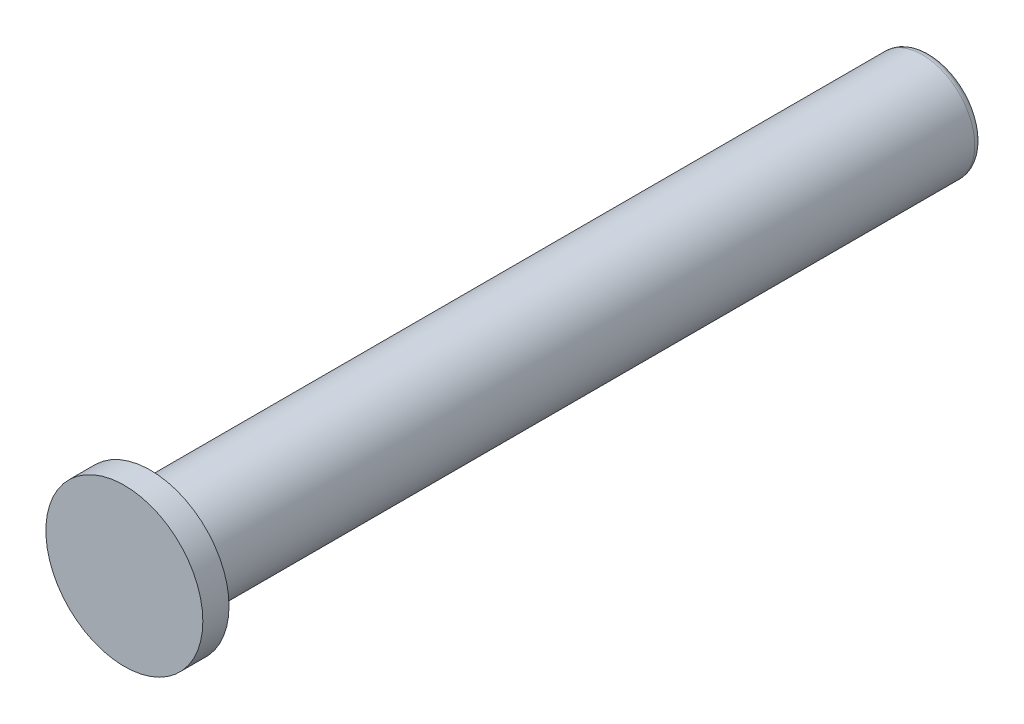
ISO-10303-21;
HEADER;
FILE_DESCRIPTION(('STEP AP214'),'2;1');
FILE_NAME('part.step','',(''),(''),'','','');
FILE_SCHEMA(('AUTOMOTIVE_DESIGN { 1 0 10303 214 1 1 1 1 }'));
ENDSEC;
DATA;
#1=APPLICATION_CONTEXT('core data for automotive mechanical design processes');
#2=APPLICATION_PROTOCOL_DEFINITION('international standard','automotive_design',2000,#1);
#3=PRODUCT_CONTEXT('',#1,'mechanical');
#4=PRODUCT('Part','Part','',(#3));
#5=PRODUCT_RELATED_PRODUCT_CATEGORY('part','',(#4));
#6=PRODUCT_DEFINITION_FORMATION('','',#4);
#7=PRODUCT_DEFINITION_CONTEXT('part definition',#1,'design');
#8=PRODUCT_DEFINITION('design','',#6,#7);
#9=PRODUCT_DEFINITION_SHAPE('','',#8);
#10=(LENGTH_UNIT() NAMED_UNIT(*) SI_UNIT(.MILLI.,.METRE.));
#11=(NAMED_UNIT(*) PLANE_ANGLE_UNIT() SI_UNIT($,.RADIAN.));
#12=(NAMED_UNIT(*) SI_UNIT($,.STERADIAN.) SOLID_ANGLE_UNIT());
#13=UNCERTAINTY_MEASURE_WITH_UNIT(LENGTH_MEASURE(1.E-05),#10,'distance_accuracy_value','');
#14=(GEOMETRIC_REPRESENTATION_CONTEXT(3) GLOBAL_UNCERTAINTY_ASSIGNED_CONTEXT((#13)) GLOBAL_UNIT_ASSIGNED_CONTEXT((#10,
#11,#12)) REPRESENTATION_CONTEXT('',''));
#15=CARTESIAN_POINT('',(0.,0.,0.));
#16=DIRECTION('',(0.,0.,1.));
#17=DIRECTION('',(1.,0.,0.));
#18=AXIS2_PLACEMENT_3D('',#15,#16,#17);
#19=CARTESIAN_POINT('',(0.,0.,0.));
#20=DIRECTION('',(0.,0.,-1.));
#21=DIRECTION('',(-1.,0.,0.));
#22=AXIS2_PLACEMENT_3D('',#19,#20,#21);
#23=PLANE('',#22);
#24=CARTESIAN_POINT('',(0.,0.,0.));
#25=DIRECTION('',(0.,0.,1.));
#26=DIRECTION('',(1.,0.,0.));
#27=AXIS2_PLACEMENT_3D('',#24,#25,#26);
#28=CIRCLE('',#27,15.);
#29=CARTESIAN_POINT('',(15.,0.,0.));
#30=VERTEX_POINT('',#29);
#31=EDGE_CURVE('E12',#30,#30,#28,.T.);
#32=ORIENTED_EDGE('',*,*,#31,.T.);
#33=EDGE_LOOP('',(#32));
#34=FACE_BOUND('',#33,.T.);
#35=ADVANCED_FACE('F37',(#34),#23,.F.);
#36=CARTESIAN_POINT('',(0.,0.,0.));
#37=DIRECTION('',(0.,0.,1.));
#38=DIRECTION('',(1.,0.,0.));
#39=AXIS2_PLACEMENT_3D('',#36,#37,#38);
#40=CYLINDRICAL_SURFACE('',#39,15.);
#41=ORIENTED_EDGE('',*,*,#31,.F.);
#42=EDGE_LOOP('',(#41));
#43=FACE_BOUND('',#42,.T.);
#44=CARTESIAN_POINT('',(0.,0.,-5.));
#45=DIRECTION('',(0.,0.,1.));
#46=DIRECTION('',(1.,0.,0.));
#47=AXIS2_PLACEMENT_3D('',#44,#45,#46);
#48=CIRCLE('',#47,15.);
#49=CARTESIAN_POINT('',(15.,0.,-5.));
#50=VERTEX_POINT('',#49);
#51=EDGE_CURVE('E44',#50,#50,#48,.T.);
#52=ORIENTED_EDGE('',*,*,#51,.T.);
#53=EDGE_LOOP('',(#52));
#54=FACE_BOUND('',#53,.T.);
#55=ADVANCED_FACE('F82',(#43,#54),#40,.T.);
#56=CARTESIAN_POINT('',(0.,15.,-5.));
#57=DIRECTION('',(0.,0.,1.));
#58=DIRECTION('',(1.,0.,0.));
#59=AXIS2_PLACEMENT_3D('',#56,#57,#58);
#60=PLANE('',#59);
#61=ORIENTED_EDGE('',*,*,#51,.F.);
#62=EDGE_LOOP('',(#61));
#63=FACE_BOUND('',#62,.T.);
#64=CARTESIAN_POINT('',(0.,0.,-5.));
#65=DIRECTION('',(0.,0.,1.));
#66=DIRECTION('',(1.,0.,0.));
#67=AXIS2_PLACEMENT_3D('',#64,#65,#66);
#68=CIRCLE('',#67,10.);
#69=CARTESIAN_POINT('',(10.,0.,-5.));
#70=VERTEX_POINT('',#69);
#71=EDGE_CURVE('E76',#70,#70,#68,.T.);
#72=ORIENTED_EDGE('',*,*,#71,.T.);
#73=EDGE_LOOP('',(#72));
#74=FACE_BOUND('',#73,.T.);
#75=ADVANCED_FACE('F84',(#63,#74),#60,.F.);
#76=CARTESIAN_POINT('',(0.,0.,0.));
#77=DIRECTION('',(0.,0.,1.));
#78=DIRECTION('',(1.,0.,0.));
#79=AXIS2_PLACEMENT_3D('',#76,#77,#78);
#80=CYLINDRICAL_SURFACE('',#79,10.);
#81=ORIENTED_EDGE('',*,*,#71,.F.);
#82=EDGE_LOOP('',(#81));
#83=FACE_BOUND('',#82,.T.);
#84=CARTESIAN_POINT('',(0.,0.,-152.5));
#85=DIRECTION('',(0.,0.,1.));
#86=DIRECTION('',(1.,0.,0.));
#87=AXIS2_PLACEMENT_3D('',#84,#85,#86);
#88=CIRCLE('',#87,10.);
#89=CARTESIAN_POINT('',(10.,0.,-152.5));
#90=VERTEX_POINT('',#89);
#91=EDGE_CURVE('E72',#90,#90,#88,.T.);
#92=ORIENTED_EDGE('',*,*,#91,.T.);
#93=EDGE_LOOP('',(#92));
#94=FACE_BOUND('',#93,.T.);
#95=ADVANCED_FACE('F87',(#83,#94),#80,.T.);
#96=CARTESIAN_POINT('',(0.,0.,-152.5));
#97=DIRECTION('',(0.,0.,1.));
#98=DIRECTION('',(1.,0.,0.));
#99=AXIS2_PLACEMENT_3D('',#96,#97,#98);
#100=TOROIDAL_SURFACE('',#99,8.5,1.5);
#101=ORIENTED_EDGE('',*,*,#91,.F.);
#102=EDGE_LOOP('',(#101));
#103=FACE_BOUND('',#102,.T.);
#104=CARTESIAN_POINT('',(0.,0.,-154.));
#105=DIRECTION('',(0.,0.,1.));
#106=DIRECTION('',(1.,0.,0.));
#107=AXIS2_PLACEMENT_3D('',#104,#105,#106);
#108=CIRCLE('',#107,8.5);
#109=CARTESIAN_POINT('',(8.5,0.,-154.));
#110=VERTEX_POINT('',#109);
#111=EDGE_CURVE('E68',#110,#110,#108,.T.);
#112=ORIENTED_EDGE('',*,*,#111,.T.);
#113=EDGE_LOOP('',(#112));
#114=FACE_BOUND('',#113,.T.);
#115=ADVANCED_FACE('F93',(#103,#114),#100,.T.);
#116=CARTESIAN_POINT('',(0.,8.5,-154.));
#117=DIRECTION('',(0.,0.,1.));
#118=DIRECTION('',(1.,0.,0.));
#119=AXIS2_PLACEMENT_3D('',#116,#117,#118);
#120=PLANE('',#119);
#121=CARTESIAN_POINT('',(0.,0.,-154.));
#122=DIRECTION('',(0.,0.,-1.));
#123=DIRECTION('',(0.,1.,0.));
#124=AXIS2_PLACEMENT_3D('',#121,#122,#123);
#125=CIRCLE('',#124,3.);
#126=CARTESIAN_POINT('',(0.,3.,-154.));
#127=VERTEX_POINT('',#126);
#128=EDGE_CURVE('E62',#127,#127,#125,.T.);
#129=ORIENTED_EDGE('',*,*,#128,.F.);
#130=EDGE_LOOP('',(#129));
#131=FACE_BOUND('',#130,.T.);
#132=ORIENTED_EDGE('',*,*,#111,.F.);
#133=EDGE_LOOP('',(#132));
#134=FACE_BOUND('',#133,.T.);
#135=ADVANCED_FACE('F99',(#131,#134),#120,.F.);
#136=CARTESIAN_POINT('',(0.,0.,-154.));
#137=DIRECTION('',(0.,0.,-1.));
#138=DIRECTION('',(0.,1.,0.));
#139=AXIS2_PLACEMENT_3D('',#136,#137,#138);
#140=CONICAL_SURFACE('',#139,3.,0.78539816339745);
#141=CARTESIAN_POINT('',(0.,0.,-153.5));
#142=DIRECTION('',(0.,0.,-1.));
#143=DIRECTION('',(0.,1.,0.));
#144=AXIS2_PLACEMENT_3D('',#141,#142,#143);
#145=CIRCLE('',#144,2.5);
#146=CARTESIAN_POINT('',(0.,2.5,-153.5));
#147=VERTEX_POINT('',#146);
#148=EDGE_CURVE('E57',#147,#147,#145,.T.);
#149=ORIENTED_EDGE('',*,*,#148,.F.);
#150=EDGE_LOOP('',(#149));
#151=FACE_BOUND('',#150,.T.);
#152=ORIENTED_EDGE('',*,*,#128,.T.);
#153=EDGE_LOOP('',(#152));
#154=FACE_BOUND('',#153,.T.);
#155=ADVANCED_FACE('F104',(#151,#154),#140,.F.);
#156=CARTESIAN_POINT('',(0.,0.,-154.));
#157=DIRECTION('',(0.,0.,-1.));
#158=DIRECTION('',(0.,1.,0.));
#159=AXIS2_PLACEMENT_3D('',#156,#157,#158);
#160=CYLINDRICAL_SURFACE('',#159,2.5);
#161=CARTESIAN_POINT('',(0.,0.,-148.));
#162=DIRECTION('',(0.,0.,-1.));
#163=DIRECTION('',(0.,1.,0.));
#164=AXIS2_PLACEMENT_3D('',#161,#162,#163);
#165=CIRCLE('',#164,2.5);
#166=CARTESIAN_POINT('',(0.,2.5,-148.));
#167=VERTEX_POINT('',#166);
#168=EDGE_CURVE('E54',#167,#167,#165,.T.);
#169=ORIENTED_EDGE('',*,*,#168,.F.);
#170=EDGE_LOOP('',(#169));
#171=FACE_BOUND('',#170,.T.);
#172=ORIENTED_EDGE('',*,*,#148,.T.);
#173=EDGE_LOOP('',(#172));
#174=FACE_BOUND('',#173,.T.);
#175=ADVANCED_FACE('F50',(#171,#174),#160,.F.);
#176=CARTESIAN_POINT('',(0.,0.,-148.));
#177=DIRECTION('',(0.,0.,-1.));
#178=DIRECTION('',(0.,1.,0.));
#179=AXIS2_PLACEMENT_3D('',#176,#177,#178);
#180=CONICAL_SURFACE('',#179,2.5,1.18682389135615);
#181=CARTESIAN_POINT('',(0.,0.,-146.989934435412));
#182=VERTEX_POINT('',#181);
#183=VERTEX_LOOP('',#182);
#184=FACE_BOUND('',#183,.T.);
#185=ORIENTED_EDGE('',*,*,#168,.T.);
#186=EDGE_LOOP('',(#185));
#187=FACE_BOUND('',#186,.T.);
#188=ADVANCED_FACE('F47',(#184,#187),#180,.F.);
#189=CLOSED_SHELL('',(#35,#55,#75,#95,#115,#135,#155,#175,#188));
#190=MANIFOLD_SOLID_BREP('B2',#189);
#191=ADVANCED_BREP_SHAPE_REPRESENTATION('',(#18,#190),#14);
#192=SHAPE_DEFINITION_REPRESENTATION(#9,#191);
ENDSEC;
END-ISO-10303-21;
